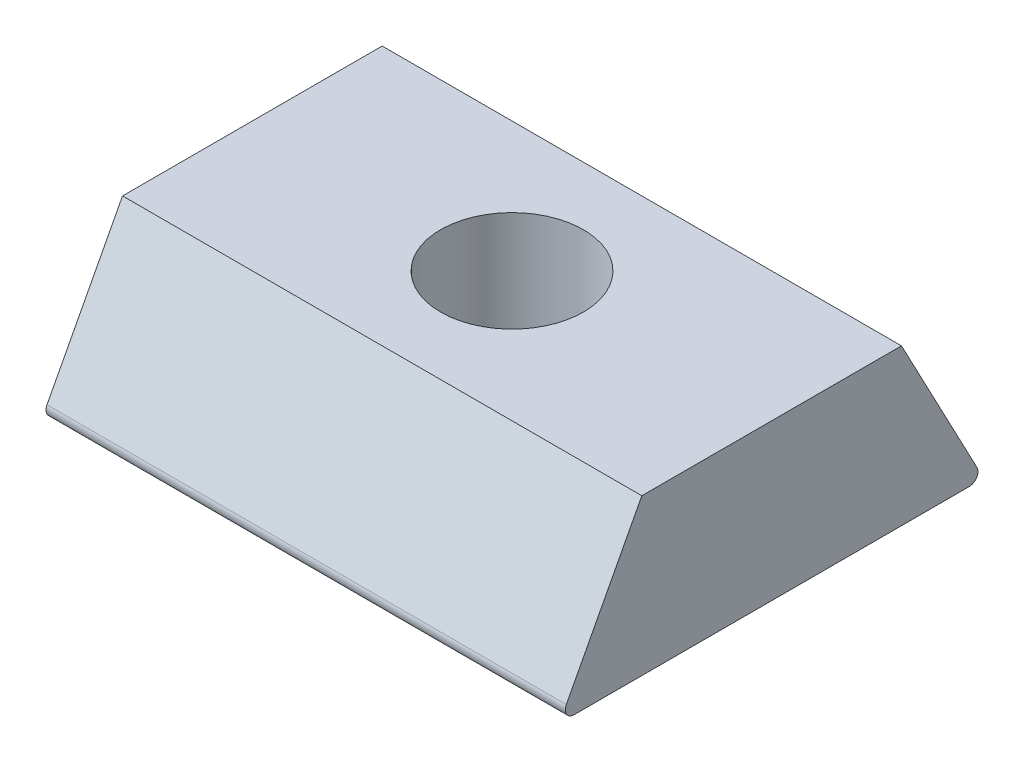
from build123d import *

# Parameters (mm, degrees)
SKETCH_1_W               = 12
SKETCH_1_H               = 9.8
EXTRUDE_1_DEPTH          = 3.6
CUT_EXTRUDE_1_DEPTH      = 14.45250906
CUT_EXTRUDE_2_DEPTH      = 14.45250906
CUT_EXTRUDE_2_DEPTH_BACK = 14.45250906
HOLE_WIZARD_M4_1_D       = 3.3
FILLET_1_R               = 0.2


with BuildPart() as part:
    # Sketch 1 → Extrude 1 (new body)
    with BuildSketch(Plane(origin=(0, 0, 0), x_dir=(1, 0, 0), z_dir=(0, 1, 0))):
        Rectangle(SKETCH_1_W, SKETCH_1_H)
    extrude(amount=EXTRUDE_1_DEPTH)

    # Sketch 3 → Cut-Extrude 1 (cut, through all)
    with BuildSketch(Plane(origin=(6, 0, 0), x_dir=(0, 0, -1), z_dir=(1, 0, 0))):
        Polygon((-19.313792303, -27.310343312), (-4.9, 0), (-3, 3.6), (11.413792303, 30.910343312), (-43.20689432, 59.737927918), (-73.934478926, 1.517241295), align=None)
    extrude(amount=-CUT_EXTRUDE_1_DEPTH, mode=Mode.SUBTRACT)

    # Sketch 4 → Cut-Extrude 2 (cut, two sides: drawn at the far end of the back side and taken through both)
    with BuildSketch(Plane(origin=(6, 0, 0), x_dir=(0, 0, -1), z_dir=(1, 0, 0)).offset(-CUT_EXTRUDE_2_DEPTH_BACK)):
        Polygon((19.313792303, -27.310343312), (4.9, 0), (3, 3.6), (-11.413792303, 30.910343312), (43.20689432, 59.737927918), (73.934478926, 1.517241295), align=None)
    extrude(amount=CUT_EXTRUDE_2_DEPTH + CUT_EXTRUDE_2_DEPTH_BACK, mode=Mode.SUBTRACT)

    # Hole Wizard M4 _1 (through all)
    with Locations(Plane(origin=(0, 3.6, 0), x_dir=(1, 0, 0), z_dir=(0, 1, 0))):
        with Locations((0, 0)):
            Hole(HOLE_WIZARD_M4_1_D / 2)

    # Fillet 1
    fillet_1_edges = [part.edges().sort_by_distance(p)[0] for p in [
        (0, 0, 4.9),
        (0, 0, -4.9),
    ]]
    fillet(fillet_1_edges, radius=FILLET_1_R)


solid = part.part
